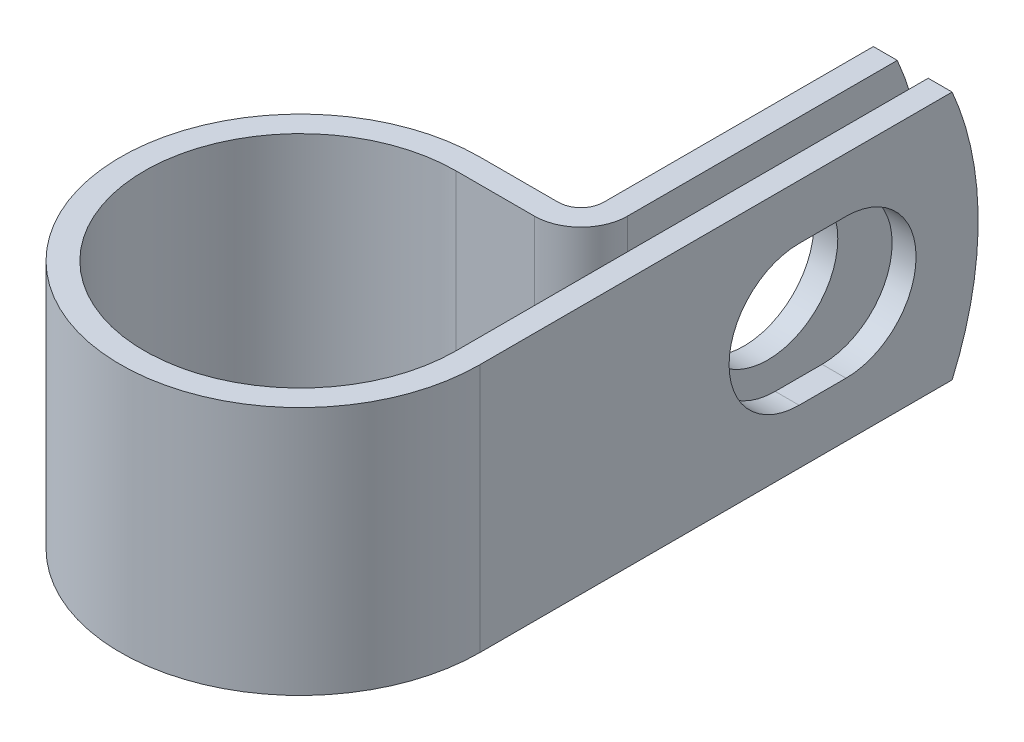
ISO-10303-21;
HEADER;
FILE_DESCRIPTION(('STEP AP214'),'2;1');
FILE_NAME('part.step','',(''),(''),'','','');
FILE_SCHEMA(('AUTOMOTIVE_DESIGN { 1 0 10303 214 1 1 1 1 }'));
ENDSEC;
DATA;
#1=APPLICATION_CONTEXT('core data for automotive mechanical design processes');
#2=APPLICATION_PROTOCOL_DEFINITION('international standard','automotive_design',2000,#1);
#3=PRODUCT_CONTEXT('',#1,'mechanical');
#4=PRODUCT('Part','Part','',(#3));
#5=PRODUCT_RELATED_PRODUCT_CATEGORY('part','',(#4));
#6=PRODUCT_DEFINITION_FORMATION('','',#4);
#7=PRODUCT_DEFINITION_CONTEXT('part definition',#1,'design');
#8=PRODUCT_DEFINITION('design','',#6,#7);
#9=PRODUCT_DEFINITION_SHAPE('','',#8);
#10=(LENGTH_UNIT() NAMED_UNIT(*) SI_UNIT(.MILLI.,.METRE.));
#11=(NAMED_UNIT(*) PLANE_ANGLE_UNIT() SI_UNIT($,.RADIAN.));
#12=(NAMED_UNIT(*) SI_UNIT($,.STERADIAN.) SOLID_ANGLE_UNIT());
#13=UNCERTAINTY_MEASURE_WITH_UNIT(LENGTH_MEASURE(1.E-05),#10,'distance_accuracy_value','');
#14=(GEOMETRIC_REPRESENTATION_CONTEXT(3) GLOBAL_UNCERTAINTY_ASSIGNED_CONTEXT((#13)) GLOBAL_UNIT_ASSIGNED_CONTEXT((#10,
#11,#12)) REPRESENTATION_CONTEXT('',''));
#15=CARTESIAN_POINT('',(0.,0.,0.));
#16=DIRECTION('',(0.,0.,1.));
#17=DIRECTION('',(1.,0.,0.));
#18=AXIS2_PLACEMENT_3D('',#15,#16,#17);
#19=CARTESIAN_POINT('',(7.9375,6.35,0.));
#20=DIRECTION('',(-1.,0.,0.));
#21=DIRECTION('',(0.,0.,1.));
#22=AXIS2_PLACEMENT_3D('',#19,#20,#21);
#23=PLANE('',#22);
#24=DIRECTION('',(0.,0.,-1.));
#25=VECTOR('',#24,1.);
#26=CARTESIAN_POINT('',(7.9375,-3.5687,-16.256));
#27=LINE('',#26,#25);
#28=CARTESIAN_POINT('',(7.9375,-3.5687,-16.256));
#29=VERTEX_POINT('',#28);
#30=CARTESIAN_POINT('',(7.9375,-3.5687,-18.6436));
#31=VERTEX_POINT('',#30);
#32=EDGE_CURVE('E236',#29,#31,#27,.T.);
#33=ORIENTED_EDGE('',*,*,#32,.T.);
#34=CARTESIAN_POINT('',(7.9375,0.,-18.6436));
#35=DIRECTION('',(-1.,0.,0.));
#36=DIRECTION('',(0.,0.,1.));
#37=AXIS2_PLACEMENT_3D('',#34,#35,#36);
#38=CIRCLE('',#37,3.5687);
#39=CARTESIAN_POINT('',(7.9375,3.5687,-18.6436));
#40=VERTEX_POINT('',#39);
#41=EDGE_CURVE('E257',#31,#40,#38,.F.);
#42=ORIENTED_EDGE('',*,*,#41,.T.);
#43=DIRECTION('',(0.,0.,1.));
#44=VECTOR('',#43,1.);
#45=CARTESIAN_POINT('',(7.9375,3.5687,-16.256));
#46=LINE('',#45,#44);
#47=CARTESIAN_POINT('',(7.9375,3.5687,-16.256));
#48=VERTEX_POINT('',#47);
#49=EDGE_CURVE('E253',#40,#48,#46,.T.);
#50=ORIENTED_EDGE('',*,*,#49,.T.);
#51=CARTESIAN_POINT('',(7.9375,0.,-16.256));
#52=DIRECTION('',(-1.,0.,0.));
#53=DIRECTION('',(0.,0.,1.));
#54=AXIS2_PLACEMENT_3D('',#51,#52,#53);
#55=CIRCLE('',#54,3.5687);
#56=EDGE_CURVE('E248',#48,#29,#55,.F.);
#57=ORIENTED_EDGE('',*,*,#56,.T.);
#58=EDGE_LOOP('',(#33,#42,#50,#57));
#59=FACE_BOUND('',#58,.T.);
#60=CARTESIAN_POINT('',(7.9375,0.,-9.4996));
#61=DIRECTION('',(-1.,0.,0.));
#62=DIRECTION('',(0.,0.,1.));
#63=AXIS2_PLACEMENT_3D('',#60,#61,#62);
#64=CIRCLE('',#63,15.875);
#65=CARTESIAN_POINT('',(7.9375,6.35,-24.0492778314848));
#66=VERTEX_POINT('',#65);
#67=CARTESIAN_POINT('',(7.9375,-6.35,-24.0492778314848));
#68=VERTEX_POINT('',#67);
#69=EDGE_CURVE('E75',#66,#68,#64,.T.);
#70=ORIENTED_EDGE('',*,*,#69,.T.);
#71=DIRECTION('',(0.,0.,-1.));
#72=VECTOR('',#71,1.);
#73=CARTESIAN_POINT('',(7.9375,-6.35,0.));
#74=LINE('',#73,#72);
#75=CARTESIAN_POINT('',(7.9375,-6.35,0.));
#76=VERTEX_POINT('',#75);
#77=EDGE_CURVE('E271',#76,#68,#74,.T.);
#78=ORIENTED_EDGE('',*,*,#77,.F.);
#79=DIRECTION('',(0.,-1.,0.));
#80=VECTOR('',#79,1.);
#81=CARTESIAN_POINT('',(7.9375,6.35,0.));
#82=LINE('',#81,#80);
#83=CARTESIAN_POINT('',(7.9375,6.35,0.));
#84=VERTEX_POINT('',#83);
#85=EDGE_CURVE('E218',#84,#76,#82,.T.);
#86=ORIENTED_EDGE('',*,*,#85,.F.);
#87=DIRECTION('',(0.,0.,-1.));
#88=VECTOR('',#87,1.);
#89=CARTESIAN_POINT('',(7.9375,6.35,-7.9375));
#90=LINE('',#89,#88);
#91=EDGE_CURVE('E273',#84,#66,#90,.T.);
#92=ORIENTED_EDGE('',*,*,#91,.T.);
#93=EDGE_LOOP('',(#70,#78,#86,#92));
#94=FACE_BOUND('',#93,.T.);
#95=ADVANCED_FACE('F54',(#59,#94),#23,.T.);
#96=CARTESIAN_POINT('',(6.3627,6.35,-25.3746));
#97=DIRECTION('',(1.,0.,0.));
#98=DIRECTION('',(0.,0.,-1.));
#99=AXIS2_PLACEMENT_3D('',#96,#97,#98);
#100=PLANE('',#99);
#101=CARTESIAN_POINT('',(6.3627,0.,-17.4498));
#102=DIRECTION('',(1.,0.,0.));
#103=DIRECTION('',(0.,0.,-1.));
#104=AXIS2_PLACEMENT_3D('',#101,#102,#103);
#105=CIRCLE('',#104,3.5687);
#106=CARTESIAN_POINT('',(6.3627,0.,-21.0185));
#107=VERTEX_POINT('',#106);
#108=EDGE_CURVE('E268',#107,#107,#105,.F.);
#109=ORIENTED_EDGE('',*,*,#108,.T.);
#110=EDGE_LOOP('',(#109));
#111=FACE_BOUND('',#110,.T.);
#112=DIRECTION('',(0.,0.,1.));
#113=VECTOR('',#112,1.);
#114=CARTESIAN_POINT('',(6.3627,-6.35,-25.3746));
#115=LINE('',#114,#113);
#116=CARTESIAN_POINT('',(6.3627,-6.35,-24.0492778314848));
#117=VERTEX_POINT('',#116);
#118=CARTESIAN_POINT('',(6.3627,-6.35,-10.31494));
#119=VERTEX_POINT('',#118);
#120=EDGE_CURVE('E184',#117,#119,#115,.T.);
#121=ORIENTED_EDGE('',*,*,#120,.F.);
#122=CARTESIAN_POINT('',(6.3627,0.,-9.4996));
#123=DIRECTION('',(1.,0.,0.));
#124=DIRECTION('',(0.,0.,-1.));
#125=AXIS2_PLACEMENT_3D('',#122,#123,#124);
#126=CIRCLE('',#125,15.875);
#127=CARTESIAN_POINT('',(6.3627,6.35,-24.0492778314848));
#128=VERTEX_POINT('',#127);
#129=EDGE_CURVE('E176',#117,#128,#126,.T.);
#130=ORIENTED_EDGE('',*,*,#129,.T.);
#131=DIRECTION('',(0.,0.,1.));
#132=VECTOR('',#131,1.);
#133=CARTESIAN_POINT('',(6.3627,6.35,-25.3746));
#134=LINE('',#133,#132);
#135=CARTESIAN_POINT('',(6.3627,6.35,-10.31494));
#136=VERTEX_POINT('',#135);
#137=EDGE_CURVE('E224',#128,#136,#134,.T.);
#138=ORIENTED_EDGE('',*,*,#137,.T.);
#139=DIRECTION('',(0.,-1.,0.));
#140=VECTOR('',#139,1.);
#141=CARTESIAN_POINT('',(6.3627,6.35,-10.31494));
#142=LINE('',#141,#140);
#143=EDGE_CURVE('E211',#136,#119,#142,.T.);
#144=ORIENTED_EDGE('',*,*,#143,.T.);
#145=EDGE_LOOP('',(#121,#130,#138,#144));
#146=FACE_BOUND('',#145,.T.);
#147=ADVANCED_FACE('F226',(#111,#146),#100,.T.);
#148=CARTESIAN_POINT('',(5.1435,6.35,-25.3746));
#149=DIRECTION('',(1.,0.,0.));
#150=DIRECTION('',(0.,0.,-1.));
#151=AXIS2_PLACEMENT_3D('',#148,#149,#150);
#152=PLANE('',#151);
#153=CARTESIAN_POINT('',(5.1435,0.,-17.4498));
#154=DIRECTION('',(-1.,0.,0.));
#155=DIRECTION('',(0.,0.,1.));
#156=AXIS2_PLACEMENT_3D('',#153,#154,#155);
#157=CIRCLE('',#156,3.5687);
#158=CARTESIAN_POINT('',(5.1435,0.,-13.8811));
#159=VERTEX_POINT('',#158);
#160=EDGE_CURVE('E265',#159,#159,#157,.T.);
#161=ORIENTED_EDGE('',*,*,#160,.F.);
#162=EDGE_LOOP('',(#161));
#163=FACE_BOUND('',#162,.T.);
#164=CARTESIAN_POINT('',(5.1435,0.,-9.4996));
#165=DIRECTION('',(-1.,0.,0.));
#166=DIRECTION('',(0.,0.,1.));
#167=AXIS2_PLACEMENT_3D('',#164,#165,#166);
#168=CIRCLE('',#167,15.875);
#169=CARTESIAN_POINT('',(5.1435,6.35,-24.0492778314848));
#170=VERTEX_POINT('',#169);
#171=CARTESIAN_POINT('',(5.1435,-6.35,-24.0492778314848));
#172=VERTEX_POINT('',#171);
#173=EDGE_CURVE('E67',#170,#172,#168,.T.);
#174=ORIENTED_EDGE('',*,*,#173,.T.);
#175=DIRECTION('',(0.,0.,1.));
#176=VECTOR('',#175,1.);
#177=CARTESIAN_POINT('',(5.1435,-6.35,-25.3746));
#178=LINE('',#177,#176);
#179=CARTESIAN_POINT('',(5.1435,-6.35,-10.31494));
#180=VERTEX_POINT('',#179);
#181=EDGE_CURVE('E167',#172,#180,#178,.T.);
#182=ORIENTED_EDGE('',*,*,#181,.T.);
#183=DIRECTION('',(0.,-1.,0.));
#184=VECTOR('',#183,1.);
#185=CARTESIAN_POINT('',(5.1435,6.35,-10.31494));
#186=LINE('',#185,#184);
#187=CARTESIAN_POINT('',(5.1435,6.35,-10.31494));
#188=VERTEX_POINT('',#187);
#189=EDGE_CURVE('E209',#188,#180,#186,.T.);
#190=ORIENTED_EDGE('',*,*,#189,.F.);
#191=DIRECTION('',(0.,0.,1.));
#192=VECTOR('',#191,1.);
#193=CARTESIAN_POINT('',(5.1435,6.35,-25.3746));
#194=LINE('',#193,#192);
#195=EDGE_CURVE('E169',#170,#188,#194,.T.);
#196=ORIENTED_EDGE('',*,*,#195,.F.);
#197=EDGE_LOOP('',(#174,#182,#190,#196));
#198=FACE_BOUND('',#197,.T.);
#199=ADVANCED_FACE('F164',(#163,#198),#152,.F.);
#200=CARTESIAN_POINT('',(9.1567,6.35,0.));
#201=DIRECTION('',(-1.,0.,0.));
#202=DIRECTION('',(0.,0.,1.));
#203=AXIS2_PLACEMENT_3D('',#200,#201,#202);
#204=PLANE('',#203);
#205=CARTESIAN_POINT('',(9.1567,0.,-18.6436));
#206=DIRECTION('',(1.,0.,0.));
#207=DIRECTION('',(0.,0.,-1.));
#208=AXIS2_PLACEMENT_3D('',#205,#206,#207);
#209=CIRCLE('',#208,3.5687);
#210=CARTESIAN_POINT('',(9.1567,-3.5687,-18.6436));
#211=VERTEX_POINT('',#210);
#212=CARTESIAN_POINT('',(9.1567,3.5687,-18.6436));
#213=VERTEX_POINT('',#212);
#214=EDGE_CURVE('E237',#211,#213,#209,.T.);
#215=ORIENTED_EDGE('',*,*,#214,.F.);
#216=DIRECTION('',(0.,0.,-1.));
#217=VECTOR('',#216,1.);
#218=CARTESIAN_POINT('',(9.1567,-3.5687,-16.256));
#219=LINE('',#218,#217);
#220=CARTESIAN_POINT('',(9.1567,-3.5687,-16.256));
#221=VERTEX_POINT('',#220);
#222=EDGE_CURVE('E240',#221,#211,#219,.T.);
#223=ORIENTED_EDGE('',*,*,#222,.F.);
#224=CARTESIAN_POINT('',(9.1567,0.,-16.256));
#225=DIRECTION('',(1.,0.,0.));
#226=DIRECTION('',(0.,0.,-1.));
#227=AXIS2_PLACEMENT_3D('',#224,#225,#226);
#228=CIRCLE('',#227,3.5687);
#229=CARTESIAN_POINT('',(9.1567,3.5687,-16.256));
#230=VERTEX_POINT('',#229);
#231=EDGE_CURVE('E230',#230,#221,#228,.T.);
#232=ORIENTED_EDGE('',*,*,#231,.F.);
#233=DIRECTION('',(0.,0.,1.));
#234=VECTOR('',#233,1.);
#235=CARTESIAN_POINT('',(9.1567,3.5687,-16.256));
#236=LINE('',#235,#234);
#237=EDGE_CURVE('E234',#213,#230,#236,.T.);
#238=ORIENTED_EDGE('',*,*,#237,.F.);
#239=EDGE_LOOP('',(#215,#223,#232,#238));
#240=FACE_BOUND('',#239,.T.);
#241=DIRECTION('',(0.,0.,-1.));
#242=VECTOR('',#241,1.);
#243=CARTESIAN_POINT('',(9.1567,-6.35,0.));
#244=LINE('',#243,#242);
#245=CARTESIAN_POINT('',(9.1567,-6.35,0.));
#246=VERTEX_POINT('',#245);
#247=CARTESIAN_POINT('',(9.1567,-6.35,-24.0492778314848));
#248=VERTEX_POINT('',#247);
#249=EDGE_CURVE('E195',#246,#248,#244,.T.);
#250=ORIENTED_EDGE('',*,*,#249,.T.);
#251=CARTESIAN_POINT('',(9.1567,0.,-9.4996));
#252=DIRECTION('',(-1.,0.,0.));
#253=DIRECTION('',(0.,0.,1.));
#254=AXIS2_PLACEMENT_3D('',#251,#252,#253);
#255=CIRCLE('',#254,15.875);
#256=CARTESIAN_POINT('',(9.1567,6.35,-24.0492778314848));
#257=VERTEX_POINT('',#256);
#258=EDGE_CURVE('E170',#257,#248,#255,.T.);
#259=ORIENTED_EDGE('',*,*,#258,.F.);
#260=DIRECTION('',(0.,0.,-1.));
#261=VECTOR('',#260,1.);
#262=CARTESIAN_POINT('',(9.1567,6.35,-7.9375));
#263=LINE('',#262,#261);
#264=CARTESIAN_POINT('',(9.1567,6.35,0.));
#265=VERTEX_POINT('',#264);
#266=EDGE_CURVE('E198',#265,#257,#263,.T.);
#267=ORIENTED_EDGE('',*,*,#266,.F.);
#268=DIRECTION('',(0.,-1.,0.));
#269=VECTOR('',#268,1.);
#270=CARTESIAN_POINT('',(9.1567,6.35,0.));
#271=LINE('',#270,#269);
#272=EDGE_CURVE('E199',#265,#246,#271,.T.);
#273=ORIENTED_EDGE('',*,*,#272,.T.);
#274=EDGE_LOOP('',(#250,#259,#267,#273));
#275=FACE_BOUND('',#274,.T.);
#276=ADVANCED_FACE('F321',(#240,#275),#204,.F.);
#277=CARTESIAN_POINT('',(0.,-6.35,0.));
#278=DIRECTION('',(0.,1.,0.));
#279=DIRECTION('',(1.,0.,0.));
#280=AXIS2_PLACEMENT_3D('',#277,#278,#279);
#281=PLANE('',#280);
#282=DIRECTION('',(-1.,0.,0.));
#283=VECTOR('',#282,1.);
#284=CARTESIAN_POINT('',(9.1567,-6.35,-24.0492778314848));
#285=LINE('',#284,#283);
#286=EDGE_CURVE('E171',#248,#68,#285,.T.);
#287=ORIENTED_EDGE('',*,*,#286,.F.);
#288=ORIENTED_EDGE('',*,*,#249,.F.);
#289=CARTESIAN_POINT('',(0.,-6.35,0.));
#290=DIRECTION('',(0.,1.,0.));
#291=DIRECTION('',(1.,0.,0.));
#292=AXIS2_PLACEMENT_3D('',#289,#290,#291);
#293=CIRCLE('',#292,9.1567);
#294=CARTESIAN_POINT('',(0.,-6.35,-9.1567));
#295=VERTEX_POINT('',#294);
#296=EDGE_CURVE('E193',#295,#246,#293,.T.);
#297=ORIENTED_EDGE('',*,*,#296,.F.);
#298=DIRECTION('',(1.,0.,0.));
#299=VECTOR('',#298,1.);
#300=CARTESIAN_POINT('',(0.,-6.35,-9.1567));
#301=LINE('',#300,#299);
#302=CARTESIAN_POINT('',(3.98526,-6.35,-9.1567));
#303=VERTEX_POINT('',#302);
#304=EDGE_CURVE('E186',#303,#295,#301,.F.);
#305=ORIENTED_EDGE('',*,*,#304,.F.);
#306=CARTESIAN_POINT('',(3.98526,-6.35,-10.31494));
#307=DIRECTION('',(0.,1.,0.));
#308=DIRECTION('',(1.,0.,0.));
#309=AXIS2_PLACEMENT_3D('',#306,#307,#308);
#310=CIRCLE('',#309,1.15824);
#311=EDGE_CURVE('E183',#180,#303,#310,.F.);
#312=ORIENTED_EDGE('',*,*,#311,.F.);
#313=ORIENTED_EDGE('',*,*,#181,.F.);
#314=DIRECTION('',(-1.,0.,0.));
#315=VECTOR('',#314,1.);
#316=CARTESIAN_POINT('',(9.1567,-6.35,-24.0492778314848));
#317=LINE('',#316,#315);
#318=EDGE_CURVE('E12',#117,#172,#317,.T.);
#319=ORIENTED_EDGE('',*,*,#318,.F.);
#320=ORIENTED_EDGE('',*,*,#120,.T.);
#321=CARTESIAN_POINT('',(3.98526,-6.35,-10.31494));
#322=DIRECTION('',(0.,-1.,0.));
#323=DIRECTION('',(0.,0.,1.));
#324=AXIS2_PLACEMENT_3D('',#321,#322,#323);
#325=CIRCLE('',#324,2.37744);
#326=CARTESIAN_POINT('',(3.98526,-6.35,-7.9375));
#327=VERTEX_POINT('',#326);
#328=EDGE_CURVE('E188',#119,#327,#325,.T.);
#329=ORIENTED_EDGE('',*,*,#328,.T.);
#330=DIRECTION('',(-1.,0.,0.));
#331=VECTOR('',#330,1.);
#332=CARTESIAN_POINT('',(0.,-6.35,-7.9375));
#333=LINE('',#332,#331);
#334=CARTESIAN_POINT('',(0.,-6.35,-7.9375));
#335=VERTEX_POINT('',#334);
#336=EDGE_CURVE('E298',#327,#335,#333,.T.);
#337=ORIENTED_EDGE('',*,*,#336,.T.);
#338=CARTESIAN_POINT('',(0.,-6.35,0.));
#339=DIRECTION('',(0.,1.,0.));
#340=DIRECTION('',(0.,0.,1.));
#341=AXIS2_PLACEMENT_3D('',#338,#339,#340);
#342=CIRCLE('',#341,7.9375);
#343=EDGE_CURVE('E295',#335,#76,#342,.T.);
#344=ORIENTED_EDGE('',*,*,#343,.T.);
#345=ORIENTED_EDGE('',*,*,#77,.T.);
#346=EDGE_LOOP('',(#287,#288,#297,#305,#312,#313,#319,#320,#329,#337,#344,#345));
#347=FACE_BOUND('',#346,.T.);
#348=ADVANCED_FACE('F181',(#347),#281,.F.);
#349=CARTESIAN_POINT('',(0.,6.35,0.));
#350=DIRECTION('',(0.,1.,0.));
#351=DIRECTION('',(1.,0.,0.));
#352=AXIS2_PLACEMENT_3D('',#349,#350,#351);
#353=PLANE('',#352);
#354=ORIENTED_EDGE('',*,*,#266,.T.);
#355=DIRECTION('',(-1.,0.,0.));
#356=VECTOR('',#355,1.);
#357=CARTESIAN_POINT('',(9.1567,6.35,-24.0492778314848));
#358=LINE('',#357,#356);
#359=EDGE_CURVE('E228',#257,#66,#358,.T.);
#360=ORIENTED_EDGE('',*,*,#359,.T.);
#361=ORIENTED_EDGE('',*,*,#91,.F.);
#362=CARTESIAN_POINT('',(0.,6.35,0.));
#363=DIRECTION('',(0.,1.,0.));
#364=DIRECTION('',(0.,0.,1.));
#365=AXIS2_PLACEMENT_3D('',#362,#363,#364);
#366=CIRCLE('',#365,7.9375);
#367=CARTESIAN_POINT('',(0.,6.35,-7.9375));
#368=VERTEX_POINT('',#367);
#369=EDGE_CURVE('E276',#368,#84,#366,.T.);
#370=ORIENTED_EDGE('',*,*,#369,.F.);
#371=DIRECTION('',(-1.,0.,0.));
#372=VECTOR('',#371,1.);
#373=CARTESIAN_POINT('',(0.,6.35,-7.9375));
#374=LINE('',#373,#372);
#375=CARTESIAN_POINT('',(3.98526,6.35,-7.9375));
#376=VERTEX_POINT('',#375);
#377=EDGE_CURVE('E279',#376,#368,#374,.T.);
#378=ORIENTED_EDGE('',*,*,#377,.F.);
#379=CARTESIAN_POINT('',(3.98526,6.35,-10.31494));
#380=DIRECTION('',(0.,-1.,0.));
#381=DIRECTION('',(0.,0.,1.));
#382=AXIS2_PLACEMENT_3D('',#379,#380,#381);
#383=CIRCLE('',#382,2.37744);
#384=EDGE_CURVE('E282',#136,#376,#383,.T.);
#385=ORIENTED_EDGE('',*,*,#384,.F.);
#386=ORIENTED_EDGE('',*,*,#137,.F.);
#387=DIRECTION('',(-1.,0.,0.));
#388=VECTOR('',#387,1.);
#389=CARTESIAN_POINT('',(9.1567,6.35,-24.0492778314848));
#390=LINE('',#389,#388);
#391=EDGE_CURVE('E61',#128,#170,#390,.T.);
#392=ORIENTED_EDGE('',*,*,#391,.T.);
#393=ORIENTED_EDGE('',*,*,#195,.T.);
#394=CARTESIAN_POINT('',(3.98526,6.35,-10.31494));
#395=DIRECTION('',(0.,1.,0.));
#396=DIRECTION('',(1.,0.,0.));
#397=AXIS2_PLACEMENT_3D('',#394,#395,#396);
#398=CIRCLE('',#397,1.15824);
#399=CARTESIAN_POINT('',(3.98526,6.35,-9.1567));
#400=VERTEX_POINT('',#399);
#401=EDGE_CURVE('E287',#188,#400,#398,.F.);
#402=ORIENTED_EDGE('',*,*,#401,.T.);
#403=DIRECTION('',(1.,0.,0.));
#404=VECTOR('',#403,1.);
#405=CARTESIAN_POINT('',(0.,6.35,-9.1567));
#406=LINE('',#405,#404);
#407=CARTESIAN_POINT('',(0.,6.35,-9.1567));
#408=VERTEX_POINT('',#407);
#409=EDGE_CURVE('E289',#400,#408,#406,.F.);
#410=ORIENTED_EDGE('',*,*,#409,.T.);
#411=CARTESIAN_POINT('',(0.,6.35,0.));
#412=DIRECTION('',(0.,1.,0.));
#413=DIRECTION('',(1.,0.,0.));
#414=AXIS2_PLACEMENT_3D('',#411,#412,#413);
#415=CIRCLE('',#414,9.1567);
#416=EDGE_CURVE('E203',#408,#265,#415,.T.);
#417=ORIENTED_EDGE('',*,*,#416,.T.);
#418=EDGE_LOOP('',(#354,#360,#361,#370,#378,#385,#386,#392,#393,#402,#410,#417));
#419=FACE_BOUND('',#418,.T.);
#420=ADVANCED_FACE('F222',(#419),#353,.T.);
#421=CARTESIAN_POINT('',(0.,6.35,0.));
#422=DIRECTION('',(0.,-1.,0.));
#423=DIRECTION('',(0.,0.,-1.));
#424=AXIS2_PLACEMENT_3D('',#421,#422,#423);
#425=CYLINDRICAL_SURFACE('',#424,7.9375);
#426=ORIENTED_EDGE('',*,*,#343,.F.);
#427=DIRECTION('',(0.,-1.,0.));
#428=VECTOR('',#427,1.);
#429=CARTESIAN_POINT('',(0.,6.35,-7.9375));
#430=LINE('',#429,#428);
#431=EDGE_CURVE('E216',#368,#335,#430,.T.);
#432=ORIENTED_EDGE('',*,*,#431,.F.);
#433=ORIENTED_EDGE('',*,*,#369,.T.);
#434=ORIENTED_EDGE('',*,*,#85,.T.);
#435=EDGE_LOOP('',(#426,#432,#433,#434));
#436=FACE_BOUND('',#435,.T.);
#437=ADVANCED_FACE('F311',(#436),#425,.F.);
#438=CARTESIAN_POINT('',(0.,6.35,-7.9375));
#439=DIRECTION('',(0.,0.,1.));
#440=DIRECTION('',(1.,0.,0.));
#441=AXIS2_PLACEMENT_3D('',#438,#439,#440);
#442=PLANE('',#441);
#443=ORIENTED_EDGE('',*,*,#336,.F.);
#444=DIRECTION('',(0.,-1.,0.));
#445=VECTOR('',#444,1.);
#446=CARTESIAN_POINT('',(3.98526,6.35,-7.9375));
#447=LINE('',#446,#445);
#448=EDGE_CURVE('E214',#376,#327,#447,.T.);
#449=ORIENTED_EDGE('',*,*,#448,.F.);
#450=ORIENTED_EDGE('',*,*,#377,.T.);
#451=ORIENTED_EDGE('',*,*,#431,.T.);
#452=EDGE_LOOP('',(#443,#449,#450,#451));
#453=FACE_BOUND('',#452,.T.);
#454=ADVANCED_FACE('F307',(#453),#442,.T.);
#455=CARTESIAN_POINT('',(3.98526,6.35,-10.31494));
#456=DIRECTION('',(0.,-1.,0.));
#457=DIRECTION('',(0.,0.,-1.));
#458=AXIS2_PLACEMENT_3D('',#455,#456,#457);
#459=CYLINDRICAL_SURFACE('',#458,2.37744);
#460=ORIENTED_EDGE('',*,*,#328,.F.);
#461=ORIENTED_EDGE('',*,*,#143,.F.);
#462=ORIENTED_EDGE('',*,*,#384,.T.);
#463=ORIENTED_EDGE('',*,*,#448,.T.);
#464=EDGE_LOOP('',(#460,#461,#462,#463));
#465=FACE_BOUND('',#464,.T.);
#466=ADVANCED_FACE('F304',(#465),#459,.T.);
#467=CARTESIAN_POINT('',(3.98526,6.35,-10.31494));
#468=DIRECTION('',(0.,-1.,0.));
#469=DIRECTION('',(0.,0.,-1.));
#470=AXIS2_PLACEMENT_3D('',#467,#468,#469);
#471=CYLINDRICAL_SURFACE('',#470,1.15824);
#472=ORIENTED_EDGE('',*,*,#311,.T.);
#473=DIRECTION('',(0.,-1.,0.));
#474=VECTOR('',#473,1.);
#475=CARTESIAN_POINT('',(3.98526,6.35,-9.1567));
#476=LINE('',#475,#474);
#477=EDGE_CURVE('E206',#400,#303,#476,.T.);
#478=ORIENTED_EDGE('',*,*,#477,.F.);
#479=ORIENTED_EDGE('',*,*,#401,.F.);
#480=ORIENTED_EDGE('',*,*,#189,.T.);
#481=EDGE_LOOP('',(#472,#478,#479,#480));
#482=FACE_BOUND('',#481,.T.);
#483=ADVANCED_FACE('F334',(#482),#471,.F.);
#484=CARTESIAN_POINT('',(0.,6.35,-9.1567));
#485=DIRECTION('',(0.,0.,1.));
#486=DIRECTION('',(1.,0.,0.));
#487=AXIS2_PLACEMENT_3D('',#484,#485,#486);
#488=PLANE('',#487);
#489=ORIENTED_EDGE('',*,*,#304,.T.);
#490=DIRECTION('',(0.,-1.,0.));
#491=VECTOR('',#490,1.);
#492=CARTESIAN_POINT('',(0.,6.35,-9.1567));
#493=LINE('',#492,#491);
#494=EDGE_CURVE('E202',#408,#295,#493,.T.);
#495=ORIENTED_EDGE('',*,*,#494,.F.);
#496=ORIENTED_EDGE('',*,*,#409,.F.);
#497=ORIENTED_EDGE('',*,*,#477,.T.);
#498=EDGE_LOOP('',(#489,#495,#496,#497));
#499=FACE_BOUND('',#498,.T.);
#500=ADVANCED_FACE('F330',(#499),#488,.F.);
#501=CARTESIAN_POINT('',(0.,6.35,0.));
#502=DIRECTION('',(0.,-1.,0.));
#503=DIRECTION('',(0.,0.,-1.));
#504=AXIS2_PLACEMENT_3D('',#501,#502,#503);
#505=CYLINDRICAL_SURFACE('',#504,9.1567);
#506=ORIENTED_EDGE('',*,*,#296,.T.);
#507=ORIENTED_EDGE('',*,*,#272,.F.);
#508=ORIENTED_EDGE('',*,*,#416,.F.);
#509=ORIENTED_EDGE('',*,*,#494,.T.);
#510=EDGE_LOOP('',(#506,#507,#508,#509));
#511=FACE_BOUND('',#510,.T.);
#512=ADVANCED_FACE('F327',(#511),#505,.T.);
#513=CARTESIAN_POINT('',(16.4565078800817,0.,-17.4498));
#514=DIRECTION('',(-1.,0.,0.));
#515=DIRECTION('',(0.,0.,1.));
#516=AXIS2_PLACEMENT_3D('',#513,#514,#515);
#517=CYLINDRICAL_SURFACE('',#516,3.5687);
#518=ORIENTED_EDGE('',*,*,#160,.T.);
#519=EDGE_LOOP('',(#518));
#520=FACE_BOUND('',#519,.T.);
#521=ORIENTED_EDGE('',*,*,#108,.F.);
#522=EDGE_LOOP('',(#521));
#523=FACE_BOUND('',#522,.T.);
#524=ADVANCED_FACE('F379',(#520,#523),#517,.F.);
#525=CARTESIAN_POINT('',(-3.96494108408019,-3.5687,-16.256));
#526=DIRECTION('',(0.,-1.,0.));
#527=DIRECTION('',(0.,0.,-1.));
#528=AXIS2_PLACEMENT_3D('',#525,#526,#527);
#529=PLANE('',#528);
#530=DIRECTION('',(1.,0.,0.));
#531=VECTOR('',#530,1.);
#532=CARTESIAN_POINT('',(-3.96494108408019,-3.5687,-16.256));
#533=LINE('',#532,#531);
#534=EDGE_CURVE('E251',#29,#221,#533,.T.);
#535=ORIENTED_EDGE('',*,*,#534,.T.);
#536=ORIENTED_EDGE('',*,*,#222,.T.);
#537=DIRECTION('',(1.,0.,0.));
#538=VECTOR('',#537,1.);
#539=CARTESIAN_POINT('',(-3.96494108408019,-3.5687,-18.6436));
#540=LINE('',#539,#538);
#541=EDGE_CURVE('E247',#31,#211,#540,.T.);
#542=ORIENTED_EDGE('',*,*,#541,.F.);
#543=ORIENTED_EDGE('',*,*,#32,.F.);
#544=EDGE_LOOP('',(#535,#536,#542,#543));
#545=FACE_BOUND('',#544,.T.);
#546=ADVANCED_FACE('F354',(#545),#529,.F.);
#547=CARTESIAN_POINT('',(-3.96494108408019,0.,-18.6436));
#548=DIRECTION('',(1.,0.,0.));
#549=DIRECTION('',(0.,0.,-1.));
#550=AXIS2_PLACEMENT_3D('',#547,#548,#549);
#551=CYLINDRICAL_SURFACE('',#550,3.5687);
#552=ORIENTED_EDGE('',*,*,#541,.T.);
#553=ORIENTED_EDGE('',*,*,#214,.T.);
#554=DIRECTION('',(1.,0.,0.));
#555=VECTOR('',#554,1.);
#556=CARTESIAN_POINT('',(-3.96494108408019,3.5687,-18.6436));
#557=LINE('',#556,#555);
#558=EDGE_CURVE('E256',#40,#213,#557,.T.);
#559=ORIENTED_EDGE('',*,*,#558,.F.);
#560=ORIENTED_EDGE('',*,*,#41,.F.);
#561=EDGE_LOOP('',(#552,#553,#559,#560));
#562=FACE_BOUND('',#561,.T.);
#563=ADVANCED_FACE('F358',(#562),#551,.F.);
#564=CARTESIAN_POINT('',(-3.96494108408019,3.5687,-16.256));
#565=DIRECTION('',(0.,1.,0.));
#566=DIRECTION('',(0.,0.,1.));
#567=AXIS2_PLACEMENT_3D('',#564,#565,#566);
#568=PLANE('',#567);
#569=ORIENTED_EDGE('',*,*,#558,.T.);
#570=ORIENTED_EDGE('',*,*,#237,.T.);
#571=DIRECTION('',(1.,0.,0.));
#572=VECTOR('',#571,1.);
#573=CARTESIAN_POINT('',(-3.96494108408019,3.5687,-16.256));
#574=LINE('',#573,#572);
#575=EDGE_CURVE('E252',#48,#230,#574,.T.);
#576=ORIENTED_EDGE('',*,*,#575,.F.);
#577=ORIENTED_EDGE('',*,*,#49,.F.);
#578=EDGE_LOOP('',(#569,#570,#576,#577));
#579=FACE_BOUND('',#578,.T.);
#580=ADVANCED_FACE('F362',(#579),#568,.F.);
#581=CARTESIAN_POINT('',(-3.96494108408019,0.,-16.256));
#582=DIRECTION('',(1.,0.,0.));
#583=DIRECTION('',(0.,0.,-1.));
#584=AXIS2_PLACEMENT_3D('',#581,#582,#583);
#585=CYLINDRICAL_SURFACE('',#584,3.5687);
#586=ORIENTED_EDGE('',*,*,#575,.T.);
#587=ORIENTED_EDGE('',*,*,#231,.T.);
#588=ORIENTED_EDGE('',*,*,#534,.F.);
#589=ORIENTED_EDGE('',*,*,#56,.F.);
#590=EDGE_LOOP('',(#586,#587,#588,#589));
#591=FACE_BOUND('',#590,.T.);
#592=ADVANCED_FACE('F366',(#591),#585,.F.);
#593=CARTESIAN_POINT('',(9.1567,0.,-9.4996));
#594=DIRECTION('',(-1.,0.,0.));
#595=DIRECTION('',(0.,0.,1.));
#596=AXIS2_PLACEMENT_3D('',#593,#594,#595);
#597=CYLINDRICAL_SURFACE('',#596,15.875);
#598=ORIENTED_EDGE('',*,*,#129,.F.);
#599=ORIENTED_EDGE('',*,*,#318,.T.);
#600=ORIENTED_EDGE('',*,*,#173,.F.);
#601=ORIENTED_EDGE('',*,*,#391,.F.);
#602=EDGE_LOOP('',(#598,#599,#600,#601));
#603=FACE_BOUND('',#602,.T.);
#604=ADVANCED_FACE('F174',(#603),#597,.T.);
#605=ORIENTED_EDGE('',*,*,#359,.F.);
#606=ORIENTED_EDGE('',*,*,#258,.T.);
#607=ORIENTED_EDGE('',*,*,#286,.T.);
#608=ORIENTED_EDGE('',*,*,#69,.F.);
#609=EDGE_LOOP('',(#605,#606,#607,#608));
#610=FACE_BOUND('',#609,.T.);
#611=ADVANCED_FACE('F316',(#610),#597,.T.);
#612=CLOSED_SHELL('',(#95,#147,#199,#276,#348,#420,#437,#454,#466,#483,#500,#512,#524,#546,#563,
#580,#592,#604,#611));
#613=MANIFOLD_SOLID_BREP('B2',#612);
#614=ADVANCED_BREP_SHAPE_REPRESENTATION('',(#18,#613),#14);
#615=SHAPE_DEFINITION_REPRESENTATION(#9,#614);
ENDSEC;
END-ISO-10303-21;
